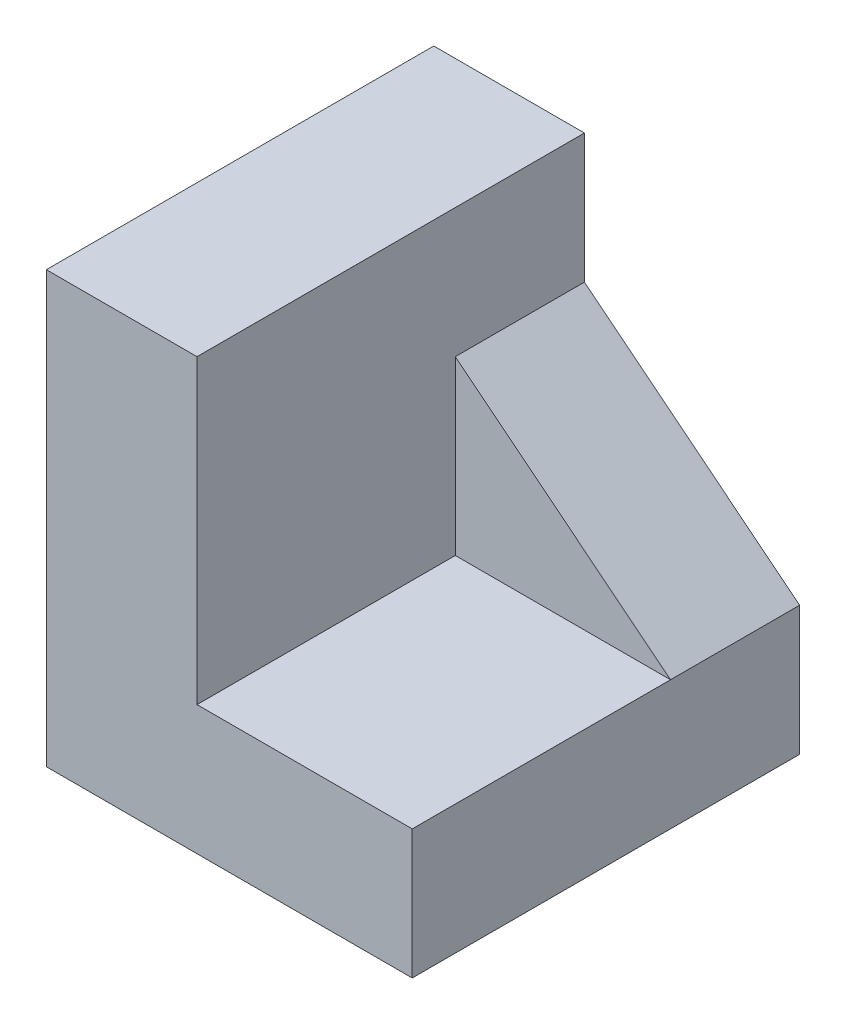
ISO-10303-21;
HEADER;
FILE_DESCRIPTION(('STEP AP214'),'2;1');
FILE_NAME('part.step','',(''),(''),'','','');
FILE_SCHEMA(('AUTOMOTIVE_DESIGN { 1 0 10303 214 1 1 1 1 }'));
ENDSEC;
DATA;
#1=APPLICATION_CONTEXT('core data for automotive mechanical design processes');
#2=APPLICATION_PROTOCOL_DEFINITION('international standard','automotive_design',2000,#1);
#3=PRODUCT_CONTEXT('',#1,'mechanical');
#4=PRODUCT('Part','Part','',(#3));
#5=PRODUCT_RELATED_PRODUCT_CATEGORY('part','',(#4));
#6=PRODUCT_DEFINITION_FORMATION('','',#4);
#7=PRODUCT_DEFINITION_CONTEXT('part definition',#1,'design');
#8=PRODUCT_DEFINITION('design','',#6,#7);
#9=PRODUCT_DEFINITION_SHAPE('','',#8);
#10=(LENGTH_UNIT() NAMED_UNIT(*) SI_UNIT(.MILLI.,.METRE.));
#11=(NAMED_UNIT(*) PLANE_ANGLE_UNIT() SI_UNIT($,.RADIAN.));
#12=(NAMED_UNIT(*) SI_UNIT($,.STERADIAN.) SOLID_ANGLE_UNIT());
#13=UNCERTAINTY_MEASURE_WITH_UNIT(LENGTH_MEASURE(1.E-05),#10,'distance_accuracy_value','');
#14=(GEOMETRIC_REPRESENTATION_CONTEXT(3) GLOBAL_UNCERTAINTY_ASSIGNED_CONTEXT((#13)) GLOBAL_UNIT_ASSIGNED_CONTEXT((#10,
#11,#12)) REPRESENTATION_CONTEXT('',''));
#15=CARTESIAN_POINT('',(0.,0.,0.));
#16=DIRECTION('',(0.,0.,1.));
#17=DIRECTION('',(1.,0.,0.));
#18=AXIS2_PLACEMENT_3D('',#15,#16,#17);
#19=CARTESIAN_POINT('',(34.,0.,36.));
#20=DIRECTION('',(0.,1.,0.));
#21=DIRECTION('',(-1.,0.,0.));
#22=AXIS2_PLACEMENT_3D('',#19,#20,#21);
#23=PLANE('',#22);
#24=DIRECTION('',(1.,0.,0.));
#25=VECTOR('',#24,1.);
#26=CARTESIAN_POINT('',(34.,0.,0.));
#27=LINE('',#26,#25);
#28=CARTESIAN_POINT('',(0.,0.,0.));
#29=VERTEX_POINT('',#28);
#30=CARTESIAN_POINT('',(34.,0.,0.));
#31=VERTEX_POINT('',#30);
#32=EDGE_CURVE('E111',#29,#31,#27,.T.);
#33=ORIENTED_EDGE('',*,*,#32,.T.);
#34=DIRECTION('',(0.,0.,-1.));
#35=VECTOR('',#34,1.);
#36=CARTESIAN_POINT('',(34.,0.,36.));
#37=LINE('',#36,#35);
#38=CARTESIAN_POINT('',(34.,0.,36.));
#39=VERTEX_POINT('',#38);
#40=EDGE_CURVE('E11',#39,#31,#37,.T.);
#41=ORIENTED_EDGE('',*,*,#40,.F.);
#42=DIRECTION('',(1.,0.,0.));
#43=VECTOR('',#42,1.);
#44=CARTESIAN_POINT('',(34.,0.,36.));
#45=LINE('',#44,#43);
#46=CARTESIAN_POINT('',(0.,0.,36.));
#47=VERTEX_POINT('',#46);
#48=EDGE_CURVE('E99',#47,#39,#45,.T.);
#49=ORIENTED_EDGE('',*,*,#48,.F.);
#50=DIRECTION('',(0.,0.,-1.));
#51=VECTOR('',#50,1.);
#52=CARTESIAN_POINT('',(0.,0.,36.));
#53=LINE('',#52,#51);
#54=EDGE_CURVE('E112',#47,#29,#53,.T.);
#55=ORIENTED_EDGE('',*,*,#54,.T.);
#56=EDGE_LOOP('',(#33,#41,#49,#55));
#57=FACE_BOUND('',#56,.T.);
#58=ADVANCED_FACE('F31',(#57),#23,.F.);
#59=CARTESIAN_POINT('',(34.,12.,36.));
#60=DIRECTION('',(-1.,0.,0.));
#61=DIRECTION('',(0.,0.,1.));
#62=AXIS2_PLACEMENT_3D('',#59,#60,#61);
#63=PLANE('',#62);
#64=DIRECTION('',(0.,1.,0.));
#65=VECTOR('',#64,1.);
#66=CARTESIAN_POINT('',(34.,12.,0.));
#67=LINE('',#66,#65);
#68=CARTESIAN_POINT('',(34.,12.,0.));
#69=VERTEX_POINT('',#68);
#70=EDGE_CURVE('E115',#31,#69,#67,.T.);
#71=ORIENTED_EDGE('',*,*,#70,.T.);
#72=DIRECTION('',(0.,0.,-1.));
#73=VECTOR('',#72,1.);
#74=CARTESIAN_POINT('',(34.,12.,12.));
#75=LINE('',#74,#73);
#76=CARTESIAN_POINT('',(34.,12.,12.));
#77=VERTEX_POINT('',#76);
#78=EDGE_CURVE('E45',#77,#69,#75,.T.);
#79=ORIENTED_EDGE('',*,*,#78,.F.);
#80=DIRECTION('',(0.,0.,-1.));
#81=VECTOR('',#80,1.);
#82=CARTESIAN_POINT('',(34.,12.,36.));
#83=LINE('',#82,#81);
#84=CARTESIAN_POINT('',(34.,12.,36.));
#85=VERTEX_POINT('',#84);
#86=EDGE_CURVE('E38',#85,#77,#83,.T.);
#87=ORIENTED_EDGE('',*,*,#86,.F.);
#88=DIRECTION('',(0.,1.,0.));
#89=VECTOR('',#88,1.);
#90=CARTESIAN_POINT('',(34.,12.,36.));
#91=LINE('',#90,#89);
#92=EDGE_CURVE('E91',#39,#85,#91,.T.);
#93=ORIENTED_EDGE('',*,*,#92,.F.);
#94=ORIENTED_EDGE('',*,*,#40,.T.);
#95=EDGE_LOOP('',(#71,#79,#87,#93,#94));
#96=FACE_BOUND('',#95,.T.);
#97=ADVANCED_FACE('F93',(#96),#63,.F.);
#98=CARTESIAN_POINT('',(14.,12.,36.));
#99=DIRECTION('',(0.,-1.,0.));
#100=DIRECTION('',(0.,0.,-1.));
#101=AXIS2_PLACEMENT_3D('',#98,#99,#100);
#102=PLANE('',#101);
#103=ORIENTED_EDGE('',*,*,#86,.T.);
#104=DIRECTION('',(-1.,0.,0.));
#105=VECTOR('',#104,1.);
#106=CARTESIAN_POINT('',(34.,12.,12.));
#107=LINE('',#106,#105);
#108=CARTESIAN_POINT('',(14.,12.,12.));
#109=VERTEX_POINT('',#108);
#110=EDGE_CURVE('E141',#77,#109,#107,.T.);
#111=ORIENTED_EDGE('',*,*,#110,.T.);
#112=DIRECTION('',(0.,0.,-1.));
#113=VECTOR('',#112,1.);
#114=CARTESIAN_POINT('',(14.,12.,36.));
#115=LINE('',#114,#113);
#116=CARTESIAN_POINT('',(14.,12.,36.));
#117=VERTEX_POINT('',#116);
#118=EDGE_CURVE('E135',#117,#109,#115,.T.);
#119=ORIENTED_EDGE('',*,*,#118,.F.);
#120=DIRECTION('',(-1.,0.,0.));
#121=VECTOR('',#120,1.);
#122=CARTESIAN_POINT('',(14.,12.,36.));
#123=LINE('',#122,#121);
#124=EDGE_CURVE('E98',#85,#117,#123,.T.);
#125=ORIENTED_EDGE('',*,*,#124,.F.);
#126=EDGE_LOOP('',(#103,#111,#119,#125));
#127=FACE_BOUND('',#126,.T.);
#128=ADVANCED_FACE('F138',(#127),#102,.F.);
#129=CARTESIAN_POINT('',(14.,40.,36.));
#130=DIRECTION('',(-1.,0.,0.));
#131=DIRECTION('',(0.,-1.,0.));
#132=AXIS2_PLACEMENT_3D('',#129,#130,#131);
#133=PLANE('',#132);
#134=DIRECTION('',(0.,1.,0.));
#135=VECTOR('',#134,1.);
#136=CARTESIAN_POINT('',(14.,12.,12.));
#137=LINE('',#136,#135);
#138=CARTESIAN_POINT('',(14.,28.,12.));
#139=VERTEX_POINT('',#138);
#140=EDGE_CURVE('E53',#109,#139,#137,.T.);
#141=ORIENTED_EDGE('',*,*,#140,.T.);
#142=DIRECTION('',(0.,0.,-1.));
#143=VECTOR('',#142,1.);
#144=CARTESIAN_POINT('',(14.,28.,12.));
#145=LINE('',#144,#143);
#146=CARTESIAN_POINT('',(14.,28.,0.));
#147=VERTEX_POINT('',#146);
#148=EDGE_CURVE('E119',#139,#147,#145,.T.);
#149=ORIENTED_EDGE('',*,*,#148,.T.);
#150=DIRECTION('',(0.,1.,0.));
#151=VECTOR('',#150,1.);
#152=CARTESIAN_POINT('',(14.,40.,0.));
#153=LINE('',#152,#151);
#154=CARTESIAN_POINT('',(14.,40.,0.));
#155=VERTEX_POINT('',#154);
#156=EDGE_CURVE('E117',#147,#155,#153,.T.);
#157=ORIENTED_EDGE('',*,*,#156,.T.);
#158=DIRECTION('',(0.,0.,-1.));
#159=VECTOR('',#158,1.);
#160=CARTESIAN_POINT('',(14.,40.,36.));
#161=LINE('',#160,#159);
#162=CARTESIAN_POINT('',(14.,40.,36.));
#163=VERTEX_POINT('',#162);
#164=EDGE_CURVE('E132',#163,#155,#161,.T.);
#165=ORIENTED_EDGE('',*,*,#164,.F.);
#166=DIRECTION('',(0.,1.,0.));
#167=VECTOR('',#166,1.);
#168=CARTESIAN_POINT('',(14.,40.,36.));
#169=LINE('',#168,#167);
#170=EDGE_CURVE('E158',#117,#163,#169,.T.);
#171=ORIENTED_EDGE('',*,*,#170,.F.);
#172=ORIENTED_EDGE('',*,*,#118,.T.);
#173=EDGE_LOOP('',(#141,#149,#157,#165,#171,#172));
#174=FACE_BOUND('',#173,.T.);
#175=ADVANCED_FACE('F171',(#174),#133,.F.);
#176=CARTESIAN_POINT('',(0.,40.,36.));
#177=DIRECTION('',(0.,-1.,0.));
#178=DIRECTION('',(0.,0.,-1.));
#179=AXIS2_PLACEMENT_3D('',#176,#177,#178);
#180=PLANE('',#179);
#181=DIRECTION('',(-1.,0.,0.));
#182=VECTOR('',#181,1.);
#183=CARTESIAN_POINT('',(0.,40.,0.));
#184=LINE('',#183,#182);
#185=CARTESIAN_POINT('',(0.,40.,0.));
#186=VERTEX_POINT('',#185);
#187=EDGE_CURVE('E125',#155,#186,#184,.T.);
#188=ORIENTED_EDGE('',*,*,#187,.T.);
#189=DIRECTION('',(0.,0.,-1.));
#190=VECTOR('',#189,1.);
#191=CARTESIAN_POINT('',(0.,40.,36.));
#192=LINE('',#191,#190);
#193=CARTESIAN_POINT('',(0.,40.,36.));
#194=VERTEX_POINT('',#193);
#195=EDGE_CURVE('E129',#194,#186,#192,.T.);
#196=ORIENTED_EDGE('',*,*,#195,.F.);
#197=DIRECTION('',(-1.,0.,0.));
#198=VECTOR('',#197,1.);
#199=CARTESIAN_POINT('',(0.,40.,36.));
#200=LINE('',#199,#198);
#201=EDGE_CURVE('E159',#163,#194,#200,.T.);
#202=ORIENTED_EDGE('',*,*,#201,.F.);
#203=ORIENTED_EDGE('',*,*,#164,.T.);
#204=EDGE_LOOP('',(#188,#196,#202,#203));
#205=FACE_BOUND('',#204,.T.);
#206=ADVANCED_FACE('F165',(#205),#180,.F.);
#207=CARTESIAN_POINT('',(0.,0.,36.));
#208=DIRECTION('',(1.,0.,0.));
#209=DIRECTION('',(0.,0.,-1.));
#210=AXIS2_PLACEMENT_3D('',#207,#208,#209);
#211=PLANE('',#210);
#212=DIRECTION('',(0.,-1.,0.));
#213=VECTOR('',#212,1.);
#214=CARTESIAN_POINT('',(0.,0.,0.));
#215=LINE('',#214,#213);
#216=EDGE_CURVE('E108',#186,#29,#215,.T.);
#217=ORIENTED_EDGE('',*,*,#216,.T.);
#218=ORIENTED_EDGE('',*,*,#54,.F.);
#219=DIRECTION('',(0.,-1.,0.));
#220=VECTOR('',#219,1.);
#221=CARTESIAN_POINT('',(0.,0.,36.));
#222=LINE('',#221,#220);
#223=EDGE_CURVE('E104',#194,#47,#222,.T.);
#224=ORIENTED_EDGE('',*,*,#223,.F.);
#225=ORIENTED_EDGE('',*,*,#195,.T.);
#226=EDGE_LOOP('',(#217,#218,#224,#225));
#227=FACE_BOUND('',#226,.T.);
#228=ADVANCED_FACE('F168',(#227),#211,.F.);
#229=CARTESIAN_POINT('',(0.,0.,36.));
#230=DIRECTION('',(0.,0.,-1.));
#231=DIRECTION('',(-1.,0.,0.));
#232=AXIS2_PLACEMENT_3D('',#229,#230,#231);
#233=PLANE('',#232);
#234=ORIENTED_EDGE('',*,*,#48,.T.);
#235=ORIENTED_EDGE('',*,*,#92,.T.);
#236=ORIENTED_EDGE('',*,*,#124,.T.);
#237=ORIENTED_EDGE('',*,*,#170,.T.);
#238=ORIENTED_EDGE('',*,*,#201,.T.);
#239=ORIENTED_EDGE('',*,*,#223,.T.);
#240=EDGE_LOOP('',(#234,#235,#236,#237,#238,#239));
#241=FACE_BOUND('',#240,.T.);
#242=ADVANCED_FACE('F102',(#241),#233,.F.);
#243=CARTESIAN_POINT('',(0.,0.,0.));
#244=DIRECTION('',(0.,0.,-1.));
#245=DIRECTION('',(-1.,0.,0.));
#246=AXIS2_PLACEMENT_3D('',#243,#244,#245);
#247=PLANE('',#246);
#248=ORIENTED_EDGE('',*,*,#156,.F.);
#249=DIRECTION('',(0.78086880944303,-0.624695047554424,0.));
#250=VECTOR('',#249,1.);
#251=CARTESIAN_POINT('',(14.,28.,0.));
#252=LINE('',#251,#250);
#253=EDGE_CURVE('E155',#147,#69,#252,.T.);
#254=ORIENTED_EDGE('',*,*,#253,.T.);
#255=ORIENTED_EDGE('',*,*,#70,.F.);
#256=ORIENTED_EDGE('',*,*,#32,.F.);
#257=ORIENTED_EDGE('',*,*,#216,.F.);
#258=ORIENTED_EDGE('',*,*,#187,.F.);
#259=EDGE_LOOP('',(#248,#254,#255,#256,#257,#258));
#260=FACE_BOUND('',#259,.T.);
#261=ADVANCED_FACE('F170',(#260),#247,.T.);
#262=CARTESIAN_POINT('',(14.,28.,12.));
#263=DIRECTION('',(0.624695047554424,0.78086880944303,0.));
#264=DIRECTION('',(-0.78086880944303,0.624695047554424,0.));
#265=AXIS2_PLACEMENT_3D('',#262,#263,#264);
#266=PLANE('',#265);
#267=ORIENTED_EDGE('',*,*,#253,.F.);
#268=ORIENTED_EDGE('',*,*,#148,.F.);
#269=DIRECTION('',(0.78086880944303,-0.624695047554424,0.));
#270=VECTOR('',#269,1.);
#271=CARTESIAN_POINT('',(14.,28.,12.));
#272=LINE('',#271,#270);
#273=EDGE_CURVE('E144',#139,#77,#272,.T.);
#274=ORIENTED_EDGE('',*,*,#273,.T.);
#275=ORIENTED_EDGE('',*,*,#78,.T.);
#276=EDGE_LOOP('',(#267,#268,#274,#275));
#277=FACE_BOUND('',#276,.T.);
#278=ADVANCED_FACE('F146',(#277),#266,.T.);
#279=CARTESIAN_POINT('',(14.,12.,12.));
#280=DIRECTION('',(0.,0.,1.));
#281=DIRECTION('',(1.,0.,0.));
#282=AXIS2_PLACEMENT_3D('',#279,#280,#281);
#283=PLANE('',#282);
#284=ORIENTED_EDGE('',*,*,#140,.F.);
#285=ORIENTED_EDGE('',*,*,#110,.F.);
#286=ORIENTED_EDGE('',*,*,#273,.F.);
#287=EDGE_LOOP('',(#284,#285,#286));
#288=FACE_BOUND('',#287,.T.);
#289=ADVANCED_FACE('F150',(#288),#283,.T.);
#290=CLOSED_SHELL('',(#58,#97,#128,#175,#206,#228,#242,#261,#278,#289));
#291=MANIFOLD_SOLID_BREP('B2',#290);
#292=ADVANCED_BREP_SHAPE_REPRESENTATION('',(#18,#291),#14);
#293=SHAPE_DEFINITION_REPRESENTATION(#9,#292);
ENDSEC;
END-ISO-10303-21;
